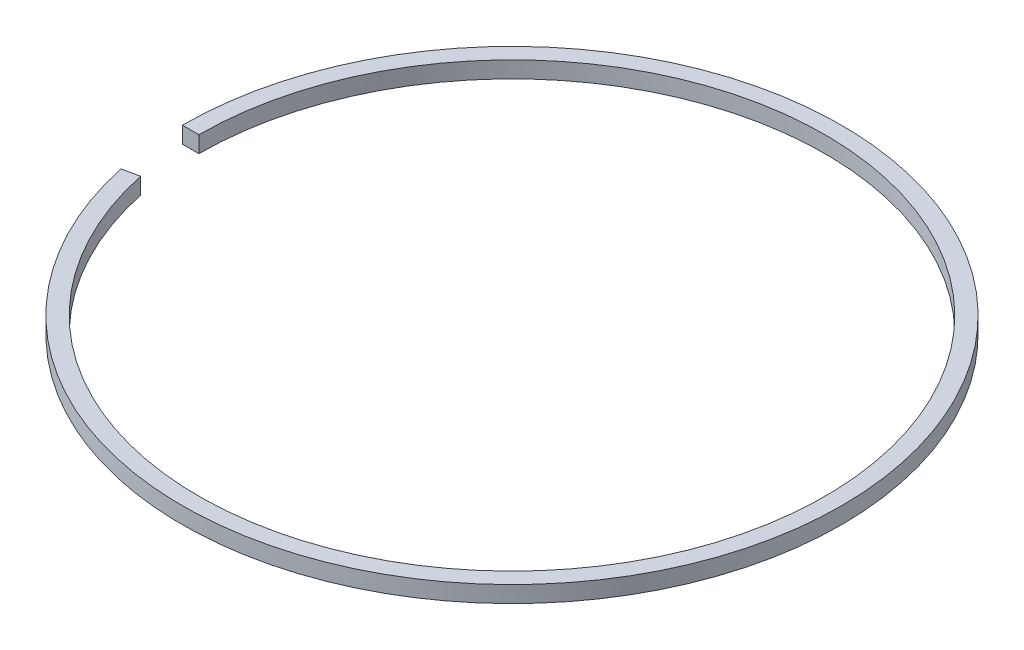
ISO-10303-21;
HEADER;
FILE_DESCRIPTION(('STEP AP214'),'2;1');
FILE_NAME('part.step','',(''),(''),'','','');
FILE_SCHEMA(('AUTOMOTIVE_DESIGN { 1 0 10303 214 1 1 1 1 }'));
ENDSEC;
DATA;
#1=APPLICATION_CONTEXT('core data for automotive mechanical design processes');
#2=APPLICATION_PROTOCOL_DEFINITION('international standard','automotive_design',2000,#1);
#3=PRODUCT_CONTEXT('',#1,'mechanical');
#4=PRODUCT('Part','Part','',(#3));
#5=PRODUCT_RELATED_PRODUCT_CATEGORY('part','',(#4));
#6=PRODUCT_DEFINITION_FORMATION('','',#4);
#7=PRODUCT_DEFINITION_CONTEXT('part definition',#1,'design');
#8=PRODUCT_DEFINITION('design','',#6,#7);
#9=PRODUCT_DEFINITION_SHAPE('','',#8);
#10=(LENGTH_UNIT() NAMED_UNIT(*) SI_UNIT(.MILLI.,.METRE.));
#11=(NAMED_UNIT(*) PLANE_ANGLE_UNIT() SI_UNIT($,.RADIAN.));
#12=(NAMED_UNIT(*) SI_UNIT($,.STERADIAN.) SOLID_ANGLE_UNIT());
#13=UNCERTAINTY_MEASURE_WITH_UNIT(LENGTH_MEASURE(1.E-05),#10,'distance_accuracy_value','');
#14=(GEOMETRIC_REPRESENTATION_CONTEXT(3) GLOBAL_UNCERTAINTY_ASSIGNED_CONTEXT((#13)) GLOBAL_UNIT_ASSIGNED_CONTEXT((#10,
#11,#12)) REPRESENTATION_CONTEXT('',''));
#15=CARTESIAN_POINT('',(0.,0.,0.));
#16=DIRECTION('',(0.,0.,1.));
#17=DIRECTION('',(1.,0.,0.));
#18=AXIS2_PLACEMENT_3D('',#15,#16,#17);
#19=CARTESIAN_POINT('',(0.,25.5310552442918,0.));
#20=DIRECTION('',(0.,1.,0.));
#21=DIRECTION('',(0.,0.,1.));
#22=AXIS2_PLACEMENT_3D('',#19,#20,#21);
#23=CYLINDRICAL_SURFACE('',#22,60.325);
#24=CARTESIAN_POINT('',(0.,3.175,0.));
#25=DIRECTION('',(0.,1.,0.));
#26=DIRECTION('',(0.,0.,1.));
#27=AXIS2_PLACEMENT_3D('',#24,#25,#26);
#28=CIRCLE('',#27,60.325);
#29=CARTESIAN_POINT('',(-59.006754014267,3.175,12.5422727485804));
#30=VERTEX_POINT('',#29);
#31=CARTESIAN_POINT('',(-60.325,3.175,0.));
#32=VERTEX_POINT('',#31);
#33=EDGE_CURVE('E11',#30,#32,#28,.T.);
#34=ORIENTED_EDGE('',*,*,#33,.T.);
#35=DIRECTION('',(0.,1.,0.));
#36=VECTOR('',#35,1.);
#37=CARTESIAN_POINT('',(-60.325,3.175,0.));
#38=LINE('',#37,#36);
#39=CARTESIAN_POINT('',(-60.325,0.,0.));
#40=VERTEX_POINT('',#39);
#41=EDGE_CURVE('E73',#40,#32,#38,.T.);
#42=ORIENTED_EDGE('',*,*,#41,.F.);
#43=CARTESIAN_POINT('',(0.,0.,0.));
#44=DIRECTION('',(0.,1.,0.));
#45=DIRECTION('',(0.,0.,1.));
#46=AXIS2_PLACEMENT_3D('',#43,#44,#45);
#47=CIRCLE('',#46,60.325);
#48=CARTESIAN_POINT('',(-59.006754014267,0.,12.5422727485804));
#49=VERTEX_POINT('',#48);
#50=EDGE_CURVE('E48',#49,#40,#47,.T.);
#51=ORIENTED_EDGE('',*,*,#50,.F.);
#52=DIRECTION('',(0.,1.,0.));
#53=VECTOR('',#52,1.);
#54=CARTESIAN_POINT('',(-59.006754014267,3.175,12.5422727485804));
#55=LINE('',#54,#53);
#56=EDGE_CURVE('E75',#49,#30,#55,.T.);
#57=ORIENTED_EDGE('',*,*,#56,.T.);
#58=EDGE_LOOP('',(#34,#42,#51,#57));
#59=FACE_BOUND('',#58,.T.);
#60=ADVANCED_FACE('F33',(#59),#23,.F.);
#61=CARTESIAN_POINT('',(-62.1123726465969,3.175,13.2023923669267));
#62=DIRECTION('',(0.,1.,0.));
#63=DIRECTION('',(0.,0.,1.));
#64=AXIS2_PLACEMENT_3D('',#61,#62,#63);
#65=PLANE('',#64);
#66=CARTESIAN_POINT('',(0.,3.175,0.));
#67=DIRECTION('',(0.,1.,0.));
#68=DIRECTION('',(0.,0.,1.));
#69=AXIS2_PLACEMENT_3D('',#66,#67,#68);
#70=CIRCLE('',#69,63.5);
#71=CARTESIAN_POINT('',(-62.1123726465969,3.175,13.2023923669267));
#72=VERTEX_POINT('',#71);
#73=CARTESIAN_POINT('',(-63.5,3.175,0.));
#74=VERTEX_POINT('',#73);
#75=EDGE_CURVE('E41',#72,#74,#70,.T.);
#76=ORIENTED_EDGE('',*,*,#75,.T.);
#77=DIRECTION('',(-1.,0.,0.));
#78=VECTOR('',#77,1.);
#79=CARTESIAN_POINT('',(-63.5,3.175,0.));
#80=LINE('',#79,#78);
#81=EDGE_CURVE('E84',#32,#74,#80,.T.);
#82=ORIENTED_EDGE('',*,*,#81,.F.);
#83=ORIENTED_EDGE('',*,*,#33,.F.);
#84=DIRECTION('',(-0.978147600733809,0.,0.207911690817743));
#85=VECTOR('',#84,1.);
#86=CARTESIAN_POINT('',(-62.1123726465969,3.175,13.2023923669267));
#87=LINE('',#86,#85);
#88=EDGE_CURVE('E94',#30,#72,#87,.T.);
#89=ORIENTED_EDGE('',*,*,#88,.T.);
#90=EDGE_LOOP('',(#76,#82,#83,#89));
#91=FACE_BOUND('',#90,.T.);
#92=ADVANCED_FACE('F35',(#91),#65,.T.);
#93=CARTESIAN_POINT('',(0.,25.5310552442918,0.));
#94=DIRECTION('',(0.,1.,0.));
#95=DIRECTION('',(0.,0.,1.));
#96=AXIS2_PLACEMENT_3D('',#93,#94,#95);
#97=CYLINDRICAL_SURFACE('',#96,63.5);
#98=CARTESIAN_POINT('',(0.,0.,0.));
#99=DIRECTION('',(0.,1.,0.));
#100=DIRECTION('',(0.,0.,1.));
#101=AXIS2_PLACEMENT_3D('',#98,#99,#100);
#102=CIRCLE('',#101,63.5);
#103=CARTESIAN_POINT('',(-62.1123726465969,0.,13.2023923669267));
#104=VERTEX_POINT('',#103);
#105=CARTESIAN_POINT('',(-63.5,0.,0.));
#106=VERTEX_POINT('',#105);
#107=EDGE_CURVE('E56',#104,#106,#102,.T.);
#108=ORIENTED_EDGE('',*,*,#107,.T.);
#109=DIRECTION('',(0.,-1.,0.));
#110=VECTOR('',#109,1.);
#111=CARTESIAN_POINT('',(-63.5,3.175,0.));
#112=LINE('',#111,#110);
#113=EDGE_CURVE('E88',#74,#106,#112,.T.);
#114=ORIENTED_EDGE('',*,*,#113,.F.);
#115=ORIENTED_EDGE('',*,*,#75,.F.);
#116=DIRECTION('',(0.,-1.,0.));
#117=VECTOR('',#116,1.);
#118=CARTESIAN_POINT('',(-62.1123726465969,3.175,13.2023923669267));
#119=LINE('',#118,#117);
#120=EDGE_CURVE('E96',#72,#104,#119,.T.);
#121=ORIENTED_EDGE('',*,*,#120,.T.);
#122=EDGE_LOOP('',(#108,#114,#115,#121));
#123=FACE_BOUND('',#122,.T.);
#124=ADVANCED_FACE('F102',(#123),#97,.T.);
#125=CARTESIAN_POINT('',(-62.1123726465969,0.,13.2023923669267));
#126=DIRECTION('',(0.,-1.,0.));
#127=DIRECTION('',(0.,0.,-1.));
#128=AXIS2_PLACEMENT_3D('',#125,#126,#127);
#129=PLANE('',#128);
#130=DIRECTION('',(0.978147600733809,0.,-0.207911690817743));
#131=VECTOR('',#130,1.);
#132=CARTESIAN_POINT('',(-62.1123726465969,0.,13.2023923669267));
#133=LINE('',#132,#131);
#134=EDGE_CURVE('E98',#104,#49,#133,.T.);
#135=ORIENTED_EDGE('',*,*,#134,.T.);
#136=ORIENTED_EDGE('',*,*,#50,.T.);
#137=DIRECTION('',(1.,0.,0.));
#138=VECTOR('',#137,1.);
#139=CARTESIAN_POINT('',(-63.5,0.,0.));
#140=LINE('',#139,#138);
#141=EDGE_CURVE('E86',#106,#40,#140,.T.);
#142=ORIENTED_EDGE('',*,*,#141,.F.);
#143=ORIENTED_EDGE('',*,*,#107,.F.);
#144=EDGE_LOOP('',(#135,#136,#142,#143));
#145=FACE_BOUND('',#144,.T.);
#146=ADVANCED_FACE('F105',(#145),#129,.T.);
#147=CARTESIAN_POINT('',(0.,0.,0.));
#148=DIRECTION('',(0.207911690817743,0.,0.978147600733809));
#149=DIRECTION('',(0.978147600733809,0.,-0.207911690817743));
#150=AXIS2_PLACEMENT_3D('',#147,#148,#149);
#151=PLANE('',#150);
#152=ORIENTED_EDGE('',*,*,#56,.F.);
#153=ORIENTED_EDGE('',*,*,#134,.F.);
#154=ORIENTED_EDGE('',*,*,#120,.F.);
#155=ORIENTED_EDGE('',*,*,#88,.F.);
#156=EDGE_LOOP('',(#152,#153,#154,#155));
#157=FACE_BOUND('',#156,.T.);
#158=ADVANCED_FACE('F107',(#157),#151,.F.);
#159=CARTESIAN_POINT('',(0.,0.,0.));
#160=DIRECTION('',(0.,0.,1.));
#161=DIRECTION('',(1.,0.,0.));
#162=AXIS2_PLACEMENT_3D('',#159,#160,#161);
#163=PLANE('',#162);
#164=ORIENTED_EDGE('',*,*,#41,.T.);
#165=ORIENTED_EDGE('',*,*,#81,.T.);
#166=ORIENTED_EDGE('',*,*,#113,.T.);
#167=ORIENTED_EDGE('',*,*,#141,.T.);
#168=EDGE_LOOP('',(#164,#165,#166,#167));
#169=FACE_BOUND('',#168,.T.);
#170=ADVANCED_FACE('F82',(#169),#163,.T.);
#171=CLOSED_SHELL('',(#60,#92,#124,#146,#158,#170));
#172=MANIFOLD_SOLID_BREP('B2',#171);
#173=ADVANCED_BREP_SHAPE_REPRESENTATION('',(#18,#172),#14);
#174=SHAPE_DEFINITION_REPRESENTATION(#9,#173);
ENDSEC;
END-ISO-10303-21;
